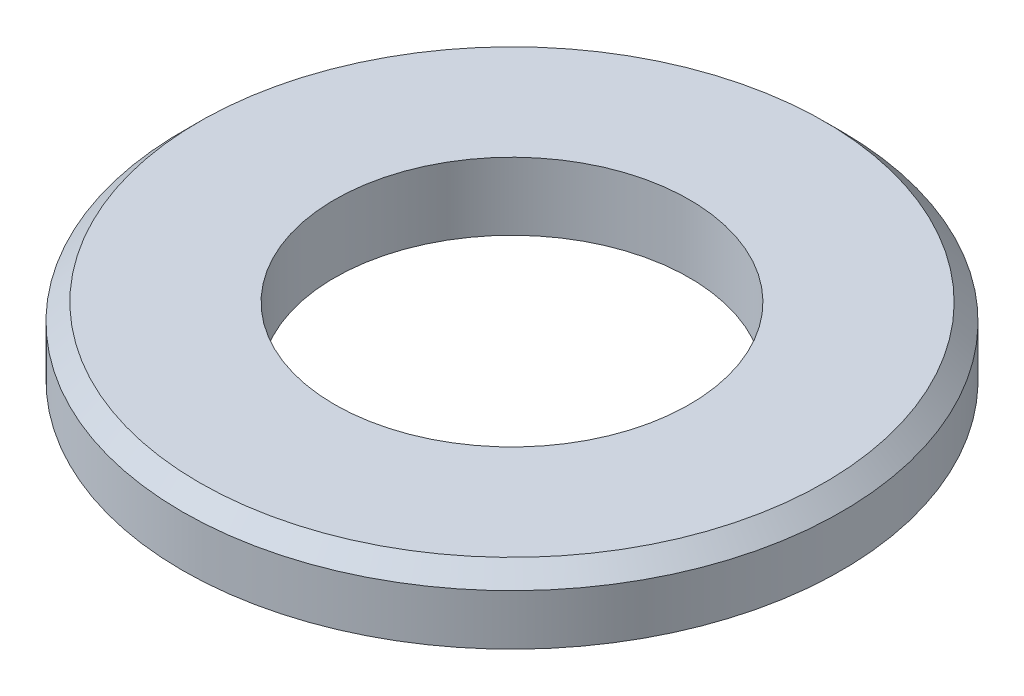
ISO-10303-21;
HEADER;
FILE_DESCRIPTION(('STEP AP214'),'2;1');
FILE_NAME('part.step','',(''),(''),'','','');
FILE_SCHEMA(('AUTOMOTIVE_DESIGN { 1 0 10303 214 1 1 1 1 }'));
ENDSEC;
DATA;
#1=APPLICATION_CONTEXT('core data for automotive mechanical design processes');
#2=APPLICATION_PROTOCOL_DEFINITION('international standard','automotive_design',2000,#1);
#3=PRODUCT_CONTEXT('',#1,'mechanical');
#4=PRODUCT('Part','Part','',(#3));
#5=PRODUCT_RELATED_PRODUCT_CATEGORY('part','',(#4));
#6=PRODUCT_DEFINITION_FORMATION('','',#4);
#7=PRODUCT_DEFINITION_CONTEXT('part definition',#1,'design');
#8=PRODUCT_DEFINITION('design','',#6,#7);
#9=PRODUCT_DEFINITION_SHAPE('','',#8);
#10=(LENGTH_UNIT() NAMED_UNIT(*) SI_UNIT(.MILLI.,.METRE.));
#11=(NAMED_UNIT(*) PLANE_ANGLE_UNIT() SI_UNIT($,.RADIAN.));
#12=(NAMED_UNIT(*) SI_UNIT($,.STERADIAN.) SOLID_ANGLE_UNIT());
#13=UNCERTAINTY_MEASURE_WITH_UNIT(LENGTH_MEASURE(1.E-05),#10,'distance_accuracy_value','');
#14=(GEOMETRIC_REPRESENTATION_CONTEXT(3) GLOBAL_UNCERTAINTY_ASSIGNED_CONTEXT((#13)) GLOBAL_UNIT_ASSIGNED_CONTEXT((#10,
#11,#12)) REPRESENTATION_CONTEXT('',''));
#15=CARTESIAN_POINT('',(0.,0.,0.));
#16=DIRECTION('',(0.,0.,1.));
#17=DIRECTION('',(1.,0.,0.));
#18=AXIS2_PLACEMENT_3D('',#15,#16,#17);
#19=CARTESIAN_POINT('',(0.,3.99999999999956,0.));
#20=DIRECTION('',(0.,1.,0.));
#21=DIRECTION('',(0.,0.,1.));
#22=AXIS2_PLACEMENT_3D('',#19,#20,#21);
#23=PLANE('',#22);
#24=CARTESIAN_POINT('',(0.,3.99999999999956,0.));
#25=DIRECTION('',(0.,1.,0.));
#26=DIRECTION('',(0.,0.,1.));
#27=AXIS2_PLACEMENT_3D('',#24,#25,#26);
#28=CIRCLE('',#27,18.5);
#29=CARTESIAN_POINT('',(0.,3.99999999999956,18.5));
#30=VERTEX_POINT('',#29);
#31=EDGE_CURVE('E51',#30,#30,#28,.T.);
#32=ORIENTED_EDGE('',*,*,#31,.T.);
#33=EDGE_LOOP('',(#32));
#34=FACE_BOUND('',#33,.T.);
#35=CARTESIAN_POINT('',(0.,3.99999999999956,0.));
#36=DIRECTION('',(0.,1.,0.));
#37=DIRECTION('',(0.,0.,1.));
#38=AXIS2_PLACEMENT_3D('',#35,#36,#37);
#39=CIRCLE('',#38,10.5);
#40=CARTESIAN_POINT('',(0.,3.99999999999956,10.5));
#41=VERTEX_POINT('',#40);
#42=EDGE_CURVE('E59',#41,#41,#39,.T.);
#43=ORIENTED_EDGE('',*,*,#42,.F.);
#44=EDGE_LOOP('',(#43));
#45=FACE_BOUND('',#44,.T.);
#46=ADVANCED_FACE('F44',(#34,#45),#23,.T.);
#47=CARTESIAN_POINT('',(0.,0.,0.));
#48=DIRECTION('',(0.,1.,0.));
#49=DIRECTION('',(0.,0.,1.));
#50=AXIS2_PLACEMENT_3D('',#47,#48,#49);
#51=PLANE('',#50);
#52=CARTESIAN_POINT('',(0.,0.,0.));
#53=DIRECTION('',(0.,1.,0.));
#54=DIRECTION('',(0.,0.,1.));
#55=AXIS2_PLACEMENT_3D('',#52,#53,#54);
#56=CIRCLE('',#55,19.5);
#57=CARTESIAN_POINT('',(0.,0.,19.5));
#58=VERTEX_POINT('',#57);
#59=EDGE_CURVE('E55',#58,#58,#56,.T.);
#60=ORIENTED_EDGE('',*,*,#59,.F.);
#61=EDGE_LOOP('',(#60));
#62=FACE_BOUND('',#61,.T.);
#63=CARTESIAN_POINT('',(0.,0.,0.));
#64=DIRECTION('',(0.,1.,0.));
#65=DIRECTION('',(0.,0.,1.));
#66=AXIS2_PLACEMENT_3D('',#63,#64,#65);
#67=CIRCLE('',#66,10.5);
#68=CARTESIAN_POINT('',(0.,0.,10.5));
#69=VERTEX_POINT('',#68);
#70=EDGE_CURVE('E62',#69,#69,#67,.T.);
#71=ORIENTED_EDGE('',*,*,#70,.T.);
#72=EDGE_LOOP('',(#71));
#73=FACE_BOUND('',#72,.T.);
#74=ADVANCED_FACE('F72',(#62,#73),#51,.F.);
#75=CARTESIAN_POINT('',(0.,3.99999999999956,0.));
#76=DIRECTION('',(0.,-1.,0.));
#77=DIRECTION('',(0.,0.,-1.));
#78=AXIS2_PLACEMENT_3D('',#75,#76,#77);
#79=CYLINDRICAL_SURFACE('',#78,19.5);
#80=CARTESIAN_POINT('',(0.,3.00000000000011,0.));
#81=DIRECTION('',(0.,1.,0.));
#82=DIRECTION('',(0.,0.,1.));
#83=AXIS2_PLACEMENT_3D('',#80,#81,#82);
#84=CIRCLE('',#83,19.5);
#85=CARTESIAN_POINT('',(0.,3.00000000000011,19.5));
#86=VERTEX_POINT('',#85);
#87=EDGE_CURVE('E12',#86,#86,#84,.F.);
#88=ORIENTED_EDGE('',*,*,#87,.T.);
#89=EDGE_LOOP('',(#88));
#90=FACE_BOUND('',#89,.T.);
#91=ORIENTED_EDGE('',*,*,#59,.T.);
#92=EDGE_LOOP('',(#91));
#93=FACE_BOUND('',#92,.T.);
#94=ADVANCED_FACE('F77',(#90,#93),#79,.T.);
#95=CARTESIAN_POINT('',(0.,3.99999999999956,0.));
#96=DIRECTION('',(0.,-1.,0.));
#97=DIRECTION('',(0.,0.,-1.));
#98=AXIS2_PLACEMENT_3D('',#95,#96,#97);
#99=CYLINDRICAL_SURFACE('',#98,10.5);
#100=ORIENTED_EDGE('',*,*,#42,.T.);
#101=EDGE_LOOP('',(#100));
#102=FACE_BOUND('',#101,.T.);
#103=ORIENTED_EDGE('',*,*,#70,.F.);
#104=EDGE_LOOP('',(#103));
#105=FACE_BOUND('',#104,.T.);
#106=ADVANCED_FACE('F68',(#102,#105),#99,.F.);
#107=CARTESIAN_POINT('',(0.,3.99999999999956,0.));
#108=DIRECTION('',(0.,-1.,0.));
#109=DIRECTION('',(0.,0.,-1.));
#110=AXIS2_PLACEMENT_3D('',#107,#108,#109);
#111=CONICAL_SURFACE('',#110,18.5,0.785398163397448);
#112=ORIENTED_EDGE('',*,*,#87,.F.);
#113=EDGE_LOOP('',(#112));
#114=FACE_BOUND('',#113,.T.);
#115=ORIENTED_EDGE('',*,*,#31,.F.);
#116=EDGE_LOOP('',(#115));
#117=FACE_BOUND('',#116,.T.);
#118=ADVANCED_FACE('F46',(#114,#117),#111,.T.);
#119=CLOSED_SHELL('',(#46,#74,#94,#106,#118));
#120=MANIFOLD_SOLID_BREP('B2',#119);
#121=ADVANCED_BREP_SHAPE_REPRESENTATION('',(#18,#120),#14);
#122=SHAPE_DEFINITION_REPRESENTATION(#9,#121);
ENDSEC;
END-ISO-10303-21;
